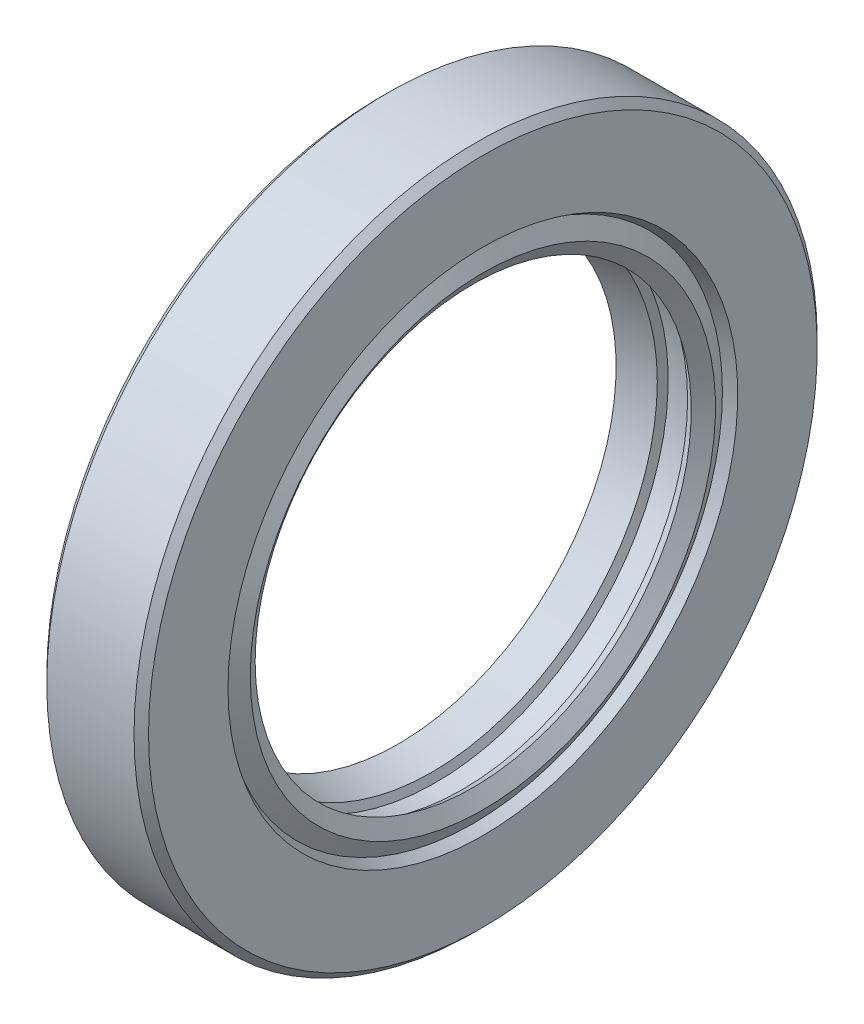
ISO-10303-21;
HEADER;
FILE_DESCRIPTION(('STEP AP214'),'2;1');
FILE_NAME('part.step','',(''),(''),'','','');
FILE_SCHEMA(('AUTOMOTIVE_DESIGN { 1 0 10303 214 1 1 1 1 }'));
ENDSEC;
DATA;
#1=APPLICATION_CONTEXT('core data for automotive mechanical design processes');
#2=APPLICATION_PROTOCOL_DEFINITION('international standard','automotive_design',2000,#1);
#3=PRODUCT_CONTEXT('',#1,'mechanical');
#4=PRODUCT('Part','Part','',(#3));
#5=PRODUCT_RELATED_PRODUCT_CATEGORY('part','',(#4));
#6=PRODUCT_DEFINITION_FORMATION('','',#4);
#7=PRODUCT_DEFINITION_CONTEXT('part definition',#1,'design');
#8=PRODUCT_DEFINITION('design','',#6,#7);
#9=PRODUCT_DEFINITION_SHAPE('','',#8);
#10=(LENGTH_UNIT() NAMED_UNIT(*) SI_UNIT(.MILLI.,.METRE.));
#11=(NAMED_UNIT(*) PLANE_ANGLE_UNIT() SI_UNIT($,.RADIAN.));
#12=(NAMED_UNIT(*) SI_UNIT($,.STERADIAN.) SOLID_ANGLE_UNIT());
#13=UNCERTAINTY_MEASURE_WITH_UNIT(LENGTH_MEASURE(1.E-05),#10,'distance_accuracy_value','');
#14=(GEOMETRIC_REPRESENTATION_CONTEXT(3) GLOBAL_UNCERTAINTY_ASSIGNED_CONTEXT((#13)) GLOBAL_UNIT_ASSIGNED_CONTEXT((#10,
#11,#12)) REPRESENTATION_CONTEXT('',''));
#15=CARTESIAN_POINT('',(0.,0.,0.));
#16=DIRECTION('',(0.,0.,1.));
#17=DIRECTION('',(1.,0.,0.));
#18=AXIS2_PLACEMENT_3D('',#15,#16,#17);
#19=CARTESIAN_POINT('',(4.,21.2142857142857,0.));
#20=DIRECTION('',(1.,0.,0.));
#21=DIRECTION('',(0.,0.,-1.));
#22=AXIS2_PLACEMENT_3D('',#19,#20,#21);
#23=PLANE('',#22);
#24=CARTESIAN_POINT('',(4.,0.,0.));
#25=DIRECTION('',(-1.,0.,0.));
#26=DIRECTION('',(0.,0.,1.));
#27=AXIS2_PLACEMENT_3D('',#24,#25,#26);
#28=CIRCLE('',#27,17.8624288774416);
#29=CARTESIAN_POINT('',(4.,0.,17.8624288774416));
#30=VERTEX_POINT('',#29);
#31=EDGE_CURVE('E10',#30,#30,#28,.T.);
#32=ORIENTED_EDGE('',*,*,#31,.F.);
#33=EDGE_LOOP('',(#32));
#34=FACE_BOUND('',#33,.T.);
#35=CARTESIAN_POINT('',(4.,0.,0.));
#36=DIRECTION('',(-1.,0.,0.));
#37=DIRECTION('',(0.,0.,1.));
#38=AXIS2_PLACEMENT_3D('',#35,#36,#37);
#39=CIRCLE('',#38,21.2142857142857);
#40=CARTESIAN_POINT('',(4.,0.,21.2142857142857));
#41=VERTEX_POINT('',#40);
#42=EDGE_CURVE('E86',#41,#41,#39,.T.);
#43=ORIENTED_EDGE('',*,*,#42,.T.);
#44=EDGE_LOOP('',(#43));
#45=FACE_BOUND('',#44,.T.);
#46=ADVANCED_FACE('F22',(#34,#45),#23,.F.);
#47=CARTESIAN_POINT('',(4.,0.,0.));
#48=DIRECTION('',(1.,0.,0.));
#49=DIRECTION('',(0.,0.,-1.));
#50=AXIS2_PLACEMENT_3D('',#47,#48,#49);
#51=CONICAL_SURFACE('',#50,17.8624288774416,0.189354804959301);
#52=CARTESIAN_POINT('',(2.9857780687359,0.,0.));
#53=DIRECTION('',(-1.,0.,0.));
#54=DIRECTION('',(0.,0.,1.));
#55=AXIS2_PLACEMENT_3D('',#52,#53,#54);
#56=CIRCLE('',#55,17.6680523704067);
#57=CARTESIAN_POINT('',(2.9857780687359,0.,17.6680523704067));
#58=VERTEX_POINT('',#57);
#59=EDGE_CURVE('E28',#58,#58,#56,.T.);
#60=ORIENTED_EDGE('',*,*,#59,.F.);
#61=EDGE_LOOP('',(#60));
#62=FACE_BOUND('',#61,.T.);
#63=ORIENTED_EDGE('',*,*,#31,.T.);
#64=EDGE_LOOP('',(#63));
#65=FACE_BOUND('',#64,.T.);
#66=ADVANCED_FACE('F195',(#62,#65),#51,.T.);
#67=CARTESIAN_POINT('',(2.,0.,0.));
#68=DIRECTION('',(-1.,0.,0.));
#69=DIRECTION('',(0.,0.,1.));
#70=AXIS2_PLACEMENT_3D('',#67,#68,#69);
#71=TOROIDAL_SURFACE('',#70,17.5,1.);
#72=CARTESIAN_POINT('',(1.13397459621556,0.,0.));
#73=DIRECTION('',(-1.,0.,0.));
#74=DIRECTION('',(0.,0.,1.));
#75=AXIS2_PLACEMENT_3D('',#72,#73,#74);
#76=CIRCLE('',#75,18.);
#77=CARTESIAN_POINT('',(1.13397459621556,0.,18.));
#78=VERTEX_POINT('',#77);
#79=EDGE_CURVE('E32',#78,#78,#76,.T.);
#80=ORIENTED_EDGE('',*,*,#79,.F.);
#81=EDGE_LOOP('',(#80));
#82=FACE_BOUND('',#81,.T.);
#83=ORIENTED_EDGE('',*,*,#59,.T.);
#84=EDGE_LOOP('',(#83));
#85=FACE_BOUND('',#84,.T.);
#86=ADVANCED_FACE('F190',(#82,#85),#71,.T.);
#87=CARTESIAN_POINT('',(0.,0.,0.));
#88=DIRECTION('',(-1.,0.,0.));
#89=DIRECTION('',(0.,0.,1.));
#90=AXIS2_PLACEMENT_3D('',#87,#88,#89);
#91=CYLINDRICAL_SURFACE('',#90,18.);
#92=CARTESIAN_POINT('',(0.5,0.,0.));
#93=DIRECTION('',(-1.,0.,0.));
#94=DIRECTION('',(0.,0.,1.));
#95=AXIS2_PLACEMENT_3D('',#92,#93,#94);
#96=CIRCLE('',#95,18.);
#97=CARTESIAN_POINT('',(0.5,0.,18.));
#98=VERTEX_POINT('',#97);
#99=EDGE_CURVE('E36',#98,#98,#96,.T.);
#100=ORIENTED_EDGE('',*,*,#99,.F.);
#101=EDGE_LOOP('',(#100));
#102=FACE_BOUND('',#101,.T.);
#103=ORIENTED_EDGE('',*,*,#79,.T.);
#104=EDGE_LOOP('',(#103));
#105=FACE_BOUND('',#104,.T.);
#106=ADVANCED_FACE('F184',(#102,#105),#91,.T.);
#107=CARTESIAN_POINT('',(0.5,18.,0.));
#108=DIRECTION('',(1.,0.,0.));
#109=DIRECTION('',(0.,0.,-1.));
#110=AXIS2_PLACEMENT_3D('',#107,#108,#109);
#111=PLANE('',#110);
#112=CARTESIAN_POINT('',(0.5,0.,0.));
#113=DIRECTION('',(-1.,0.,0.));
#114=DIRECTION('',(0.,0.,1.));
#115=AXIS2_PLACEMENT_3D('',#112,#113,#114);
#116=CIRCLE('',#115,16.);
#117=CARTESIAN_POINT('',(0.5,0.,16.));
#118=VERTEX_POINT('',#117);
#119=EDGE_CURVE('E41',#118,#118,#116,.T.);
#120=ORIENTED_EDGE('',*,*,#119,.F.);
#121=EDGE_LOOP('',(#120));
#122=FACE_BOUND('',#121,.T.);
#123=ORIENTED_EDGE('',*,*,#99,.T.);
#124=EDGE_LOOP('',(#123));
#125=FACE_BOUND('',#124,.T.);
#126=ADVANCED_FACE('F178',(#122,#125),#111,.F.);
#127=CARTESIAN_POINT('',(0.5,0.,0.));
#128=DIRECTION('',(-1.,0.,0.));
#129=DIRECTION('',(0.,0.,1.));
#130=AXIS2_PLACEMENT_3D('',#127,#128,#129);
#131=CONICAL_SURFACE('',#130,16.,0.9827937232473);
#132=CARTESIAN_POINT('',(1.16666666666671,0.,0.));
#133=DIRECTION('',(-1.,0.,0.));
#134=DIRECTION('',(0.,0.,1.));
#135=AXIS2_PLACEMENT_3D('',#132,#133,#134);
#136=CIRCLE('',#135,15.);
#137=CARTESIAN_POINT('',(1.16666666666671,0.,15.));
#138=VERTEX_POINT('',#137);
#139=EDGE_CURVE('E44',#138,#138,#136,.T.);
#140=ORIENTED_EDGE('',*,*,#139,.F.);
#141=EDGE_LOOP('',(#140));
#142=FACE_BOUND('',#141,.T.);
#143=ORIENTED_EDGE('',*,*,#119,.T.);
#144=EDGE_LOOP('',(#143));
#145=FACE_BOUND('',#144,.T.);
#146=ADVANCED_FACE('F172',(#142,#145),#131,.F.);
#147=CARTESIAN_POINT('',(1.16666666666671,0.,0.));
#148=DIRECTION('',(1.,0.,0.));
#149=DIRECTION('',(0.,0.,-1.));
#150=AXIS2_PLACEMENT_3D('',#147,#148,#149);
#151=CONICAL_SURFACE('',#150,15.,0.21109333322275);
#152=CARTESIAN_POINT('',(3.5,0.,0.));
#153=DIRECTION('',(-1.,0.,0.));
#154=DIRECTION('',(0.,0.,1.));
#155=AXIS2_PLACEMENT_3D('',#152,#153,#154);
#156=CIRCLE('',#155,15.5);
#157=CARTESIAN_POINT('',(3.5,0.,15.5));
#158=VERTEX_POINT('',#157);
#159=EDGE_CURVE('E47',#158,#158,#156,.T.);
#160=ORIENTED_EDGE('',*,*,#159,.F.);
#161=EDGE_LOOP('',(#160));
#162=FACE_BOUND('',#161,.T.);
#163=ORIENTED_EDGE('',*,*,#139,.T.);
#164=EDGE_LOOP('',(#163));
#165=FACE_BOUND('',#164,.T.);
#166=ADVANCED_FACE('F166',(#162,#165),#151,.F.);
#167=CARTESIAN_POINT('',(3.5,0.,0.));
#168=DIRECTION('',(1.,0.,0.));
#169=DIRECTION('',(0.,0.,-1.));
#170=AXIS2_PLACEMENT_3D('',#167,#168,#169);
#171=CONICAL_SURFACE('',#170,15.5,1.10714871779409);
#172=CARTESIAN_POINT('',(3.75,0.,0.));
#173=DIRECTION('',(-1.,0.,0.));
#174=DIRECTION('',(0.,0.,1.));
#175=AXIS2_PLACEMENT_3D('',#172,#173,#174);
#176=CIRCLE('',#175,16.);
#177=CARTESIAN_POINT('',(3.75,0.,16.));
#178=VERTEX_POINT('',#177);
#179=EDGE_CURVE('E50',#178,#178,#176,.T.);
#180=ORIENTED_EDGE('',*,*,#179,.F.);
#181=EDGE_LOOP('',(#180));
#182=FACE_BOUND('',#181,.T.);
#183=ORIENTED_EDGE('',*,*,#159,.T.);
#184=EDGE_LOOP('',(#183));
#185=FACE_BOUND('',#184,.T.);
#186=ADVANCED_FACE('F160',(#182,#185),#171,.F.);
#187=CARTESIAN_POINT('',(0.,0.,0.));
#188=DIRECTION('',(-1.,0.,0.));
#189=DIRECTION('',(0.,0.,1.));
#190=AXIS2_PLACEMENT_3D('',#187,#188,#189);
#191=CYLINDRICAL_SURFACE('',#190,16.);
#192=CARTESIAN_POINT('',(5.29166666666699,0.,0.));
#193=DIRECTION('',(-1.,0.,0.));
#194=DIRECTION('',(0.,0.,1.));
#195=AXIS2_PLACEMENT_3D('',#192,#193,#194);
#196=CIRCLE('',#195,16.);
#197=CARTESIAN_POINT('',(5.29166666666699,0.,16.));
#198=VERTEX_POINT('',#197);
#199=EDGE_CURVE('E53',#198,#198,#196,.T.);
#200=ORIENTED_EDGE('',*,*,#199,.F.);
#201=EDGE_LOOP('',(#200));
#202=FACE_BOUND('',#201,.T.);
#203=ORIENTED_EDGE('',*,*,#179,.T.);
#204=EDGE_LOOP('',(#203));
#205=FACE_BOUND('',#204,.T.);
#206=ADVANCED_FACE('F154',(#202,#205),#191,.F.);
#207=CARTESIAN_POINT('',(5.29166666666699,0.,0.));
#208=DIRECTION('',(-1.,0.,0.));
#209=DIRECTION('',(0.,0.,1.));
#210=AXIS2_PLACEMENT_3D('',#207,#208,#209);
#211=CONICAL_SURFACE('',#210,16.,1.04272187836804);
#212=CARTESIAN_POINT('',(5.58333333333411,0.,0.));
#213=DIRECTION('',(-1.,0.,0.));
#214=DIRECTION('',(0.,0.,1.));
#215=AXIS2_PLACEMENT_3D('',#212,#213,#214);
#216=CIRCLE('',#215,15.4999999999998);
#217=CARTESIAN_POINT('',(5.58333333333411,0.,15.4999999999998));
#218=VERTEX_POINT('',#217);
#219=EDGE_CURVE('E56',#218,#218,#216,.T.);
#220=ORIENTED_EDGE('',*,*,#219,.F.);
#221=EDGE_LOOP('',(#220));
#222=FACE_BOUND('',#221,.T.);
#223=ORIENTED_EDGE('',*,*,#199,.T.);
#224=EDGE_LOOP('',(#223));
#225=FACE_BOUND('',#224,.T.);
#226=ADVANCED_FACE('F148',(#222,#225),#211,.F.);
#227=CARTESIAN_POINT('',(5.58333333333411,0.,0.));
#228=DIRECTION('',(-1.,0.,0.));
#229=DIRECTION('',(0.,0.,1.));
#230=AXIS2_PLACEMENT_3D('',#227,#228,#229);
#231=CONICAL_SURFACE('',#230,15.4999999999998,0.588002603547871);
#232=CARTESIAN_POINT('',(6.33333333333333,0.,0.));
#233=DIRECTION('',(-1.,0.,0.));
#234=DIRECTION('',(0.,0.,1.));
#235=AXIS2_PLACEMENT_3D('',#232,#233,#234);
#236=CIRCLE('',#235,15.);
#237=CARTESIAN_POINT('',(6.33333333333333,0.,15.));
#238=VERTEX_POINT('',#237);
#239=EDGE_CURVE('E59',#238,#238,#236,.T.);
#240=ORIENTED_EDGE('',*,*,#239,.F.);
#241=EDGE_LOOP('',(#240));
#242=FACE_BOUND('',#241,.T.);
#243=ORIENTED_EDGE('',*,*,#219,.T.);
#244=EDGE_LOOP('',(#243));
#245=FACE_BOUND('',#244,.T.);
#246=ADVANCED_FACE('F142',(#242,#245),#231,.F.);
#247=CARTESIAN_POINT('',(6.33333333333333,0.,0.));
#248=DIRECTION('',(1.,0.,0.));
#249=DIRECTION('',(0.,0.,-1.));
#250=AXIS2_PLACEMENT_3D('',#247,#248,#249);
#251=CONICAL_SURFACE('',#250,15.,0.982793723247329);
#252=CARTESIAN_POINT('',(7.,0.,0.));
#253=DIRECTION('',(-1.,0.,0.));
#254=DIRECTION('',(0.,0.,1.));
#255=AXIS2_PLACEMENT_3D('',#252,#253,#254);
#256=CIRCLE('',#255,16.);
#257=CARTESIAN_POINT('',(7.,0.,16.));
#258=VERTEX_POINT('',#257);
#259=EDGE_CURVE('E62',#258,#258,#256,.T.);
#260=ORIENTED_EDGE('',*,*,#259,.F.);
#261=EDGE_LOOP('',(#260));
#262=FACE_BOUND('',#261,.T.);
#263=ORIENTED_EDGE('',*,*,#239,.T.);
#264=EDGE_LOOP('',(#263));
#265=FACE_BOUND('',#264,.T.);
#266=ADVANCED_FACE('F136',(#262,#265),#251,.F.);
#267=CARTESIAN_POINT('',(7.,0.,0.));
#268=DIRECTION('',(-1.,0.,0.));
#269=DIRECTION('',(0.,0.,1.));
#270=AXIS2_PLACEMENT_3D('',#267,#268,#269);
#271=CONICAL_SURFACE('',#270,16.,1.04446522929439);
#272=CARTESIAN_POINT('',(6.33333333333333,0.,0.));
#273=DIRECTION('',(-1.,0.,0.));
#274=DIRECTION('',(0.,0.,1.));
#275=AXIS2_PLACEMENT_3D('',#272,#273,#274);
#276=CIRCLE('',#275,17.1474486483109);
#277=CARTESIAN_POINT('',(6.33333333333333,0.,17.1474486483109));
#278=VERTEX_POINT('',#277);
#279=EDGE_CURVE('E65',#278,#278,#276,.T.);
#280=ORIENTED_EDGE('',*,*,#279,.F.);
#281=EDGE_LOOP('',(#280));
#282=FACE_BOUND('',#281,.T.);
#283=ORIENTED_EDGE('',*,*,#259,.T.);
#284=EDGE_LOOP('',(#283));
#285=FACE_BOUND('',#284,.T.);
#286=ADVANCED_FACE('F130',(#282,#285),#271,.T.);
#287=CARTESIAN_POINT('',(6.33333333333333,0.,0.));
#288=DIRECTION('',(1.,0.,0.));
#289=DIRECTION('',(0.,0.,-1.));
#290=AXIS2_PLACEMENT_3D('',#287,#288,#289);
#291=CONICAL_SURFACE('',#290,17.1474486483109,0.526331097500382);
#292=CARTESIAN_POINT('',(7.00000000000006,0.,0.));
#293=DIRECTION('',(-1.,0.,0.));
#294=DIRECTION('',(0.,0.,1.));
#295=AXIS2_PLACEMENT_3D('',#292,#293,#294);
#296=CIRCLE('',#295,17.5347814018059);
#297=CARTESIAN_POINT('',(7.00000000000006,0.,17.5347814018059));
#298=VERTEX_POINT('',#297);
#299=EDGE_CURVE('E68',#298,#298,#296,.T.);
#300=ORIENTED_EDGE('',*,*,#299,.F.);
#301=EDGE_LOOP('',(#300));
#302=FACE_BOUND('',#301,.T.);
#303=ORIENTED_EDGE('',*,*,#279,.T.);
#304=EDGE_LOOP('',(#303));
#305=FACE_BOUND('',#304,.T.);
#306=ADVANCED_FACE('F124',(#302,#305),#291,.F.);
#307=CARTESIAN_POINT('',(7.,23.,0.));
#308=DIRECTION('',(-1.,0.,0.));
#309=DIRECTION('',(0.,0.,1.));
#310=AXIS2_PLACEMENT_3D('',#307,#308,#309);
#311=PLANE('',#310);
#312=CARTESIAN_POINT('',(7.,0.,0.));
#313=DIRECTION('',(-1.,0.,0.));
#314=DIRECTION('',(0.,0.,1.));
#315=AXIS2_PLACEMENT_3D('',#312,#313,#314);
#316=CIRCLE('',#315,23.);
#317=CARTESIAN_POINT('',(7.,0.,23.));
#318=VERTEX_POINT('',#317);
#319=EDGE_CURVE('E71',#318,#318,#316,.T.);
#320=ORIENTED_EDGE('',*,*,#319,.F.);
#321=EDGE_LOOP('',(#320));
#322=FACE_BOUND('',#321,.T.);
#323=ORIENTED_EDGE('',*,*,#299,.T.);
#324=EDGE_LOOP('',(#323));
#325=FACE_BOUND('',#324,.T.);
#326=ADVANCED_FACE('F118',(#322,#325),#311,.F.);
#327=CARTESIAN_POINT('',(7.,0.,0.));
#328=DIRECTION('',(-1.,0.,0.));
#329=DIRECTION('',(0.,0.,1.));
#330=AXIS2_PLACEMENT_3D('',#327,#328,#329);
#331=CONICAL_SURFACE('',#330,23.,0.785398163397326);
#332=CARTESIAN_POINT('',(6.49999999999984,0.,0.));
#333=DIRECTION('',(-1.,0.,0.));
#334=DIRECTION('',(0.,0.,1.));
#335=AXIS2_PLACEMENT_3D('',#332,#333,#334);
#336=CIRCLE('',#335,23.5);
#337=CARTESIAN_POINT('',(6.49999999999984,0.,23.5));
#338=VERTEX_POINT('',#337);
#339=EDGE_CURVE('E74',#338,#338,#336,.T.);
#340=ORIENTED_EDGE('',*,*,#339,.F.);
#341=EDGE_LOOP('',(#340));
#342=FACE_BOUND('',#341,.T.);
#343=ORIENTED_EDGE('',*,*,#319,.T.);
#344=EDGE_LOOP('',(#343));
#345=FACE_BOUND('',#344,.T.);
#346=ADVANCED_FACE('F112',(#342,#345),#331,.T.);
#347=CARTESIAN_POINT('',(0.,0.,0.));
#348=DIRECTION('',(-1.,0.,0.));
#349=DIRECTION('',(0.,0.,1.));
#350=AXIS2_PLACEMENT_3D('',#347,#348,#349);
#351=CYLINDRICAL_SURFACE('',#350,23.5);
#352=CARTESIAN_POINT('',(0.499999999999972,0.,0.));
#353=DIRECTION('',(-1.,0.,0.));
#354=DIRECTION('',(0.,0.,1.));
#355=AXIS2_PLACEMENT_3D('',#352,#353,#354);
#356=CIRCLE('',#355,23.5);
#357=CARTESIAN_POINT('',(0.499999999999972,0.,23.5));
#358=VERTEX_POINT('',#357);
#359=EDGE_CURVE('E77',#358,#358,#356,.T.);
#360=ORIENTED_EDGE('',*,*,#359,.F.);
#361=EDGE_LOOP('',(#360));
#362=FACE_BOUND('',#361,.T.);
#363=ORIENTED_EDGE('',*,*,#339,.T.);
#364=EDGE_LOOP('',(#363));
#365=FACE_BOUND('',#364,.T.);
#366=ADVANCED_FACE('F106',(#362,#365),#351,.T.);
#367=CARTESIAN_POINT('',(0.499999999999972,0.,0.));
#368=DIRECTION('',(1.,0.,0.));
#369=DIRECTION('',(0.,0.,-1.));
#370=AXIS2_PLACEMENT_3D('',#367,#368,#369);
#371=CONICAL_SURFACE('',#370,23.5,0.785398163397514);
#372=CARTESIAN_POINT('',(0.,0.,0.));
#373=DIRECTION('',(-1.,0.,0.));
#374=DIRECTION('',(0.,0.,1.));
#375=AXIS2_PLACEMENT_3D('',#372,#373,#374);
#376=CIRCLE('',#375,23.);
#377=CARTESIAN_POINT('',(0.,0.,23.));
#378=VERTEX_POINT('',#377);
#379=EDGE_CURVE('E80',#378,#378,#376,.T.);
#380=ORIENTED_EDGE('',*,*,#379,.F.);
#381=EDGE_LOOP('',(#380));
#382=FACE_BOUND('',#381,.T.);
#383=ORIENTED_EDGE('',*,*,#359,.T.);
#384=EDGE_LOOP('',(#383));
#385=FACE_BOUND('',#384,.T.);
#386=ADVANCED_FACE('F100',(#382,#385),#371,.T.);
#387=CARTESIAN_POINT('',(0.,23.,0.));
#388=DIRECTION('',(1.,0.,0.));
#389=DIRECTION('',(0.,0.,-1.));
#390=AXIS2_PLACEMENT_3D('',#387,#388,#389);
#391=PLANE('',#390);
#392=CARTESIAN_POINT('',(0.,0.,0.));
#393=DIRECTION('',(-1.,0.,0.));
#394=DIRECTION('',(0.,0.,1.));
#395=AXIS2_PLACEMENT_3D('',#392,#393,#394);
#396=CIRCLE('',#395,21.5);
#397=CARTESIAN_POINT('',(0.,0.,21.5));
#398=VERTEX_POINT('',#397);
#399=EDGE_CURVE('E83',#398,#398,#396,.T.);
#400=ORIENTED_EDGE('',*,*,#399,.F.);
#401=EDGE_LOOP('',(#400));
#402=FACE_BOUND('',#401,.T.);
#403=ORIENTED_EDGE('',*,*,#379,.T.);
#404=EDGE_LOOP('',(#403));
#405=FACE_BOUND('',#404,.T.);
#406=ADVANCED_FACE('F94',(#402,#405),#391,.F.);
#407=CARTESIAN_POINT('',(0.,0.,0.));
#408=DIRECTION('',(-1.,0.,0.));
#409=DIRECTION('',(0.,0.,1.));
#410=AXIS2_PLACEMENT_3D('',#407,#408,#409);
#411=CONICAL_SURFACE('',#410,21.5,0.0713074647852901);
#412=ORIENTED_EDGE('',*,*,#42,.F.);
#413=EDGE_LOOP('',(#412));
#414=FACE_BOUND('',#413,.T.);
#415=ORIENTED_EDGE('',*,*,#399,.T.);
#416=EDGE_LOOP('',(#415));
#417=FACE_BOUND('',#416,.T.);
#418=ADVANCED_FACE('F91',(#414,#417),#411,.F.);
#419=CLOSED_SHELL('',(#46,#66,#86,#106,#126,#146,#166,#186,#206,#226,#246,#266,#286,#306,#326,
#346,#366,#386,#406,#418));
#420=MANIFOLD_SOLID_BREP('B2',#419);
#421=ADVANCED_BREP_SHAPE_REPRESENTATION('',(#18,#420),#14);
#422=SHAPE_DEFINITION_REPRESENTATION(#9,#421);
ENDSEC;
END-ISO-10303-21;
